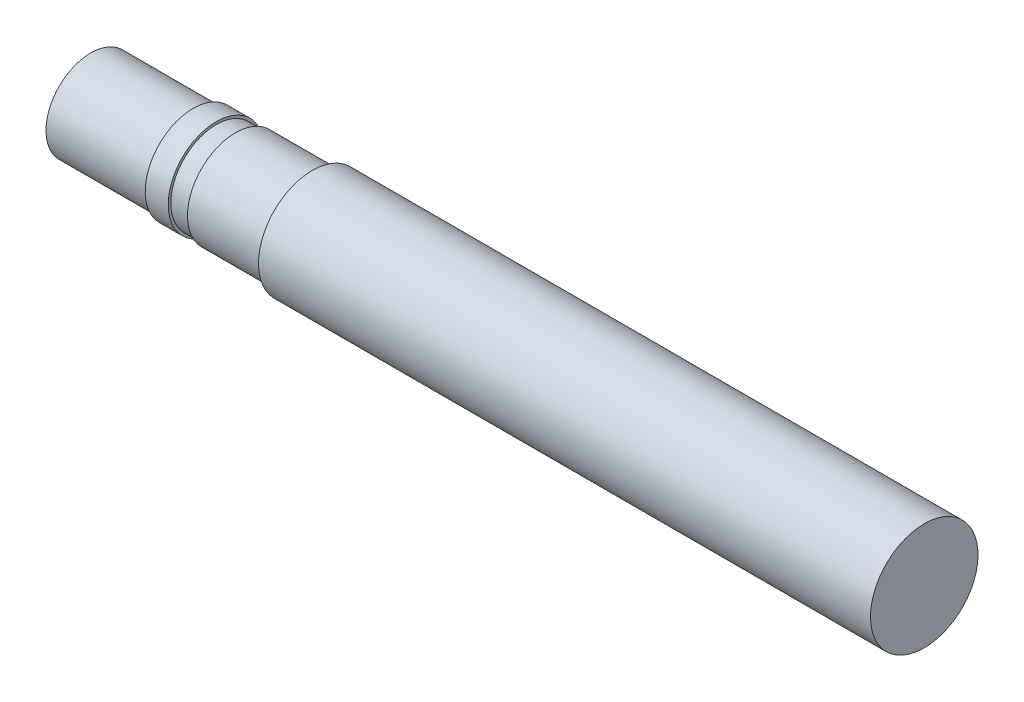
ISO-10303-21;
HEADER;
FILE_DESCRIPTION(('STEP AP214'),'2;1');
FILE_NAME('part.step','',(''),(''),'','','');
FILE_SCHEMA(('AUTOMOTIVE_DESIGN { 1 0 10303 214 1 1 1 1 }'));
ENDSEC;
DATA;
#1=APPLICATION_CONTEXT('core data for automotive mechanical design processes');
#2=APPLICATION_PROTOCOL_DEFINITION('international standard','automotive_design',2000,#1);
#3=PRODUCT_CONTEXT('',#1,'mechanical');
#4=PRODUCT('Part','Part','',(#3));
#5=PRODUCT_RELATED_PRODUCT_CATEGORY('part','',(#4));
#6=PRODUCT_DEFINITION_FORMATION('','',#4);
#7=PRODUCT_DEFINITION_CONTEXT('part definition',#1,'design');
#8=PRODUCT_DEFINITION('design','',#6,#7);
#9=PRODUCT_DEFINITION_SHAPE('','',#8);
#10=(LENGTH_UNIT() NAMED_UNIT(*) SI_UNIT(.MILLI.,.METRE.));
#11=(NAMED_UNIT(*) PLANE_ANGLE_UNIT() SI_UNIT($,.RADIAN.));
#12=(NAMED_UNIT(*) SI_UNIT($,.STERADIAN.) SOLID_ANGLE_UNIT());
#13=UNCERTAINTY_MEASURE_WITH_UNIT(LENGTH_MEASURE(1.E-05),#10,'distance_accuracy_value','');
#14=(GEOMETRIC_REPRESENTATION_CONTEXT(3) GLOBAL_UNCERTAINTY_ASSIGNED_CONTEXT((#13)) GLOBAL_UNIT_ASSIGNED_CONTEXT((#10,
#11,#12)) REPRESENTATION_CONTEXT('',''));
#15=CARTESIAN_POINT('',(0.,0.,0.));
#16=DIRECTION('',(0.,0.,1.));
#17=DIRECTION('',(1.,0.,0.));
#18=AXIS2_PLACEMENT_3D('',#15,#16,#17);
#19=CARTESIAN_POINT('',(-571.,34.9999999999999,0.));
#20=DIRECTION('',(-1.,0.,0.));
#21=DIRECTION('',(0.,-1.,0.));
#22=AXIS2_PLACEMENT_3D('',#19,#20,#21);
#23=PLANE('',#22);
#24=CARTESIAN_POINT('',(-571.,0.,0.));
#25=DIRECTION('',(1.,0.,0.));
#26=DIRECTION('',(0.,1.,0.));
#27=AXIS2_PLACEMENT_3D('',#24,#25,#26);
#28=CIRCLE('',#27,35.);
#29=CARTESIAN_POINT('',(-571.,34.9999999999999,0.));
#30=VERTEX_POINT('',#29);
#31=EDGE_CURVE('E64',#30,#30,#28,.T.);
#32=ORIENTED_EDGE('',*,*,#31,.T.);
#33=EDGE_LOOP('',(#32));
#34=FACE_BOUND('',#33,.T.);
#35=CARTESIAN_POINT('',(-571.,0.,0.));
#36=DIRECTION('',(1.,0.,0.));
#37=DIRECTION('',(0.,1.,0.));
#38=AXIS2_PLACEMENT_3D('',#35,#36,#37);
#39=CIRCLE('',#38,37.5);
#40=CARTESIAN_POINT('',(-571.,37.4999999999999,0.));
#41=VERTEX_POINT('',#40);
#42=EDGE_CURVE('E10',#41,#41,#39,.T.);
#43=ORIENTED_EDGE('',*,*,#42,.F.);
#44=EDGE_LOOP('',(#43));
#45=FACE_BOUND('',#44,.T.);
#46=ADVANCED_FACE('F30',(#34,#45),#23,.T.);
#47=CARTESIAN_POINT('',(0.,0.,0.));
#48=DIRECTION('',(1.,0.,0.));
#49=DIRECTION('',(0.,1.,0.));
#50=AXIS2_PLACEMENT_3D('',#47,#48,#49);
#51=CYLINDRICAL_SURFACE('',#50,37.5);
#52=ORIENTED_EDGE('',*,*,#42,.T.);
#53=EDGE_LOOP('',(#52));
#54=FACE_BOUND('',#53,.T.);
#55=CARTESIAN_POINT('',(-553.,0.,0.));
#56=DIRECTION('',(1.,0.,0.));
#57=DIRECTION('',(0.,1.,0.));
#58=AXIS2_PLACEMENT_3D('',#55,#56,#57);
#59=CIRCLE('',#58,37.5);
#60=CARTESIAN_POINT('',(-553.,37.4999999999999,0.));
#61=VERTEX_POINT('',#60);
#62=EDGE_CURVE('E36',#61,#61,#59,.T.);
#63=ORIENTED_EDGE('',*,*,#62,.F.);
#64=EDGE_LOOP('',(#63));
#65=FACE_BOUND('',#64,.T.);
#66=ADVANCED_FACE('F82',(#54,#65),#51,.T.);
#67=CARTESIAN_POINT('',(-553.,37.4999999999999,0.));
#68=DIRECTION('',(1.,0.,0.));
#69=DIRECTION('',(0.,1.,0.));
#70=AXIS2_PLACEMENT_3D('',#67,#68,#69);
#71=PLANE('',#70);
#72=ORIENTED_EDGE('',*,*,#62,.T.);
#73=EDGE_LOOP('',(#72));
#74=FACE_BOUND('',#73,.T.);
#75=CARTESIAN_POINT('',(-553.,0.,0.));
#76=DIRECTION('',(1.,0.,0.));
#77=DIRECTION('',(0.,1.,0.));
#78=AXIS2_PLACEMENT_3D('',#75,#76,#77);
#79=CIRCLE('',#78,35.5);
#80=CARTESIAN_POINT('',(-553.,35.4999999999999,0.));
#81=VERTEX_POINT('',#80);
#82=EDGE_CURVE('E40',#81,#81,#79,.T.);
#83=ORIENTED_EDGE('',*,*,#82,.F.);
#84=EDGE_LOOP('',(#83));
#85=FACE_BOUND('',#84,.T.);
#86=ADVANCED_FACE('F86',(#74,#85),#71,.T.);
#87=CARTESIAN_POINT('',(0.,0.,0.));
#88=DIRECTION('',(1.,0.,0.));
#89=DIRECTION('',(0.,1.,0.));
#90=AXIS2_PLACEMENT_3D('',#87,#88,#89);
#91=CYLINDRICAL_SURFACE('',#90,35.5);
#92=ORIENTED_EDGE('',*,*,#82,.T.);
#93=EDGE_LOOP('',(#92));
#94=FACE_BOUND('',#93,.T.);
#95=CARTESIAN_POINT('',(-538.,0.,0.));
#96=DIRECTION('',(1.,0.,0.));
#97=DIRECTION('',(0.,1.,0.));
#98=AXIS2_PLACEMENT_3D('',#95,#96,#97);
#99=CIRCLE('',#98,35.5);
#100=CARTESIAN_POINT('',(-538.,35.4999999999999,0.));
#101=VERTEX_POINT('',#100);
#102=EDGE_CURVE('E44',#101,#101,#99,.T.);
#103=ORIENTED_EDGE('',*,*,#102,.F.);
#104=EDGE_LOOP('',(#103));
#105=FACE_BOUND('',#104,.T.);
#106=ADVANCED_FACE('F90',(#94,#105),#91,.T.);
#107=CARTESIAN_POINT('',(-538.,35.4999999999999,0.));
#108=DIRECTION('',(-1.,0.,0.));
#109=DIRECTION('',(0.,-1.,0.));
#110=AXIS2_PLACEMENT_3D('',#107,#108,#109);
#111=PLANE('',#110);
#112=ORIENTED_EDGE('',*,*,#102,.T.);
#113=EDGE_LOOP('',(#112));
#114=FACE_BOUND('',#113,.T.);
#115=CARTESIAN_POINT('',(-538.,0.,0.));
#116=DIRECTION('',(1.,0.,0.));
#117=DIRECTION('',(0.,1.,0.));
#118=AXIS2_PLACEMENT_3D('',#115,#116,#117);
#119=CIRCLE('',#118,37.5);
#120=CARTESIAN_POINT('',(-538.,37.4999999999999,0.));
#121=VERTEX_POINT('',#120);
#122=EDGE_CURVE('E49',#121,#121,#119,.T.);
#123=ORIENTED_EDGE('',*,*,#122,.F.);
#124=EDGE_LOOP('',(#123));
#125=FACE_BOUND('',#124,.T.);
#126=ADVANCED_FACE('F96',(#114,#125),#111,.T.);
#127=CARTESIAN_POINT('',(0.,0.,0.));
#128=DIRECTION('',(1.,0.,0.));
#129=DIRECTION('',(0.,1.,0.));
#130=AXIS2_PLACEMENT_3D('',#127,#128,#129);
#131=CYLINDRICAL_SURFACE('',#130,37.5);
#132=ORIENTED_EDGE('',*,*,#122,.T.);
#133=EDGE_LOOP('',(#132));
#134=FACE_BOUND('',#133,.T.);
#135=CARTESIAN_POINT('',(-478.,0.,0.));
#136=DIRECTION('',(1.,0.,0.));
#137=DIRECTION('',(0.,1.,0.));
#138=AXIS2_PLACEMENT_3D('',#135,#136,#137);
#139=CIRCLE('',#138,37.5);
#140=CARTESIAN_POINT('',(-478.,37.4999999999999,0.));
#141=VERTEX_POINT('',#140);
#142=EDGE_CURVE('E52',#141,#141,#139,.T.);
#143=ORIENTED_EDGE('',*,*,#142,.F.);
#144=EDGE_LOOP('',(#143));
#145=FACE_BOUND('',#144,.T.);
#146=ADVANCED_FACE('F100',(#134,#145),#131,.T.);
#147=CARTESIAN_POINT('',(-478.,37.4999999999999,0.));
#148=DIRECTION('',(-1.,0.,0.));
#149=DIRECTION('',(0.,-1.,0.));
#150=AXIS2_PLACEMENT_3D('',#147,#148,#149);
#151=PLANE('',#150);
#152=ORIENTED_EDGE('',*,*,#142,.T.);
#153=EDGE_LOOP('',(#152));
#154=FACE_BOUND('',#153,.T.);
#155=CARTESIAN_POINT('',(-478.,0.,0.));
#156=DIRECTION('',(1.,0.,0.));
#157=DIRECTION('',(0.,1.,0.));
#158=AXIS2_PLACEMENT_3D('',#155,#156,#157);
#159=CIRCLE('',#158,42.0000000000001);
#160=CARTESIAN_POINT('',(-478.,42.,0.));
#161=VERTEX_POINT('',#160);
#162=EDGE_CURVE('E55',#161,#161,#159,.T.);
#163=ORIENTED_EDGE('',*,*,#162,.F.);
#164=EDGE_LOOP('',(#163));
#165=FACE_BOUND('',#164,.T.);
#166=ADVANCED_FACE('F104',(#154,#165),#151,.T.);
#167=CARTESIAN_POINT('',(0.,0.,0.));
#168=DIRECTION('',(1.,0.,0.));
#169=DIRECTION('',(0.,1.,0.));
#170=AXIS2_PLACEMENT_3D('',#167,#168,#169);
#171=CYLINDRICAL_SURFACE('',#170,42.);
#172=ORIENTED_EDGE('',*,*,#162,.T.);
#173=EDGE_LOOP('',(#172));
#174=FACE_BOUND('',#173,.T.);
#175=CARTESIAN_POINT('',(0.,0.,0.));
#176=DIRECTION('',(1.,0.,0.));
#177=DIRECTION('',(0.,1.,0.));
#178=AXIS2_PLACEMENT_3D('',#175,#176,#177);
#179=CIRCLE('',#178,42.);
#180=CARTESIAN_POINT('',(0.,42.,0.));
#181=VERTEX_POINT('',#180);
#182=EDGE_CURVE('E58',#181,#181,#179,.T.);
#183=ORIENTED_EDGE('',*,*,#182,.F.);
#184=EDGE_LOOP('',(#183));
#185=FACE_BOUND('',#184,.T.);
#186=ADVANCED_FACE('F108',(#174,#185),#171,.T.);
#187=CARTESIAN_POINT('',(0.,42.,0.));
#188=DIRECTION('',(1.,0.,0.));
#189=DIRECTION('',(0.,1.,0.));
#190=AXIS2_PLACEMENT_3D('',#187,#188,#189);
#191=PLANE('',#190);
#192=ORIENTED_EDGE('',*,*,#182,.T.);
#193=EDGE_LOOP('',(#192));
#194=FACE_BOUND('',#193,.T.);
#195=ADVANCED_FACE('F78',(#194),#191,.T.);
#196=CARTESIAN_POINT('',(-651.,34.9999999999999,0.));
#197=DIRECTION('',(-1.,0.,0.));
#198=DIRECTION('',(0.,-1.,0.));
#199=AXIS2_PLACEMENT_3D('',#196,#197,#198);
#200=PLANE('',#199);
#201=CARTESIAN_POINT('',(-651.,0.,0.));
#202=DIRECTION('',(1.,0.,0.));
#203=DIRECTION('',(0.,1.,0.));
#204=AXIS2_PLACEMENT_3D('',#201,#202,#203);
#205=CIRCLE('',#204,35.);
#206=CARTESIAN_POINT('',(-651.,34.9999999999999,0.));
#207=VERTEX_POINT('',#206);
#208=EDGE_CURVE('E61',#207,#207,#205,.T.);
#209=ORIENTED_EDGE('',*,*,#208,.F.);
#210=EDGE_LOOP('',(#209));
#211=FACE_BOUND('',#210,.T.);
#212=ADVANCED_FACE('F72',(#211),#200,.T.);
#213=CARTESIAN_POINT('',(0.,0.,0.));
#214=DIRECTION('',(1.,0.,0.));
#215=DIRECTION('',(0.,1.,0.));
#216=AXIS2_PLACEMENT_3D('',#213,#214,#215);
#217=CYLINDRICAL_SURFACE('',#216,35.);
#218=ORIENTED_EDGE('',*,*,#208,.T.);
#219=EDGE_LOOP('',(#218));
#220=FACE_BOUND('',#219,.T.);
#221=ORIENTED_EDGE('',*,*,#31,.F.);
#222=EDGE_LOOP('',(#221));
#223=FACE_BOUND('',#222,.T.);
#224=ADVANCED_FACE('F70',(#220,#223),#217,.T.);
#225=CLOSED_SHELL('',(#46,#66,#86,#106,#126,#146,#166,#186,#195,#212,#224));
#226=MANIFOLD_SOLID_BREP('B2',#225);
#227=ADVANCED_BREP_SHAPE_REPRESENTATION('',(#18,#226),#14);
#228=SHAPE_DEFINITION_REPRESENTATION(#9,#227);
ENDSEC;
END-ISO-10303-21;
